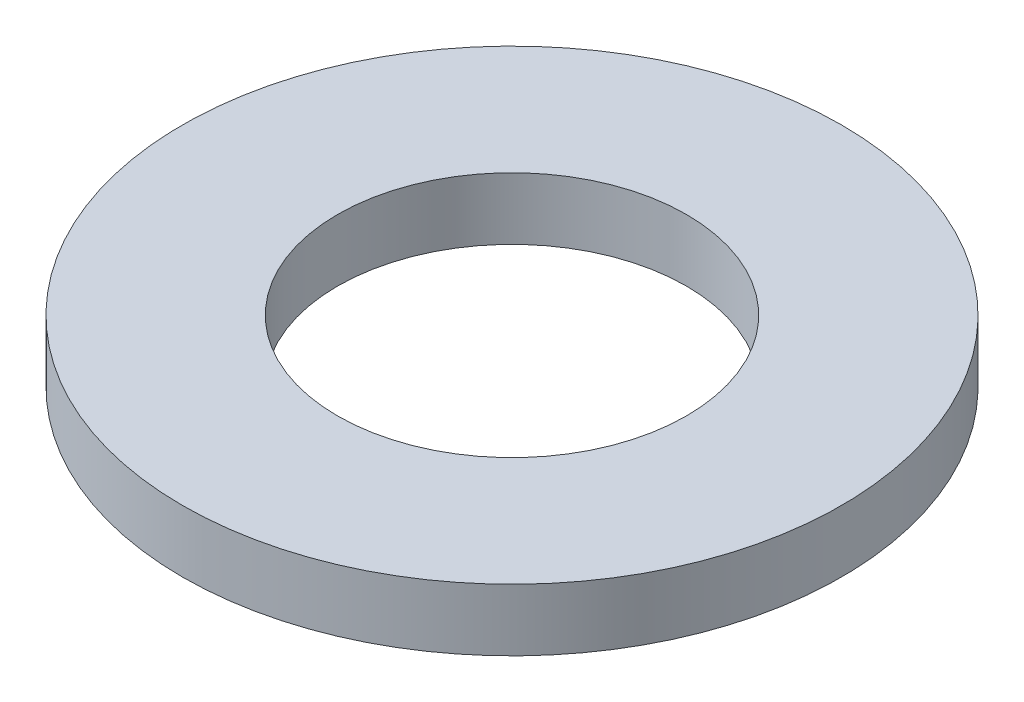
from build123d import *

# Parameters (mm, degrees)
BODYSKE_W = 4
BODYSKE_H = 1.6


with BuildPart() as part:
    # BodySke → BaseBody (revolve)
    with BuildSketch(Plane(origin=(0, 0, 0), x_dir=(1, 0, 0), z_dir=(0, 0, -1)), mode=Mode.PRIVATE) as basebody_sk:
        with Locations((6.5, 0.8)):
            Rectangle(BODYSKE_W, BODYSKE_H)
    revolve(basebody_sk.sketch.rotate(Axis((0, 0, 0), (0, -1, 0)), 90), axis=Axis((0, 0, 0), (0, -1, 0)))


solid = part.part
